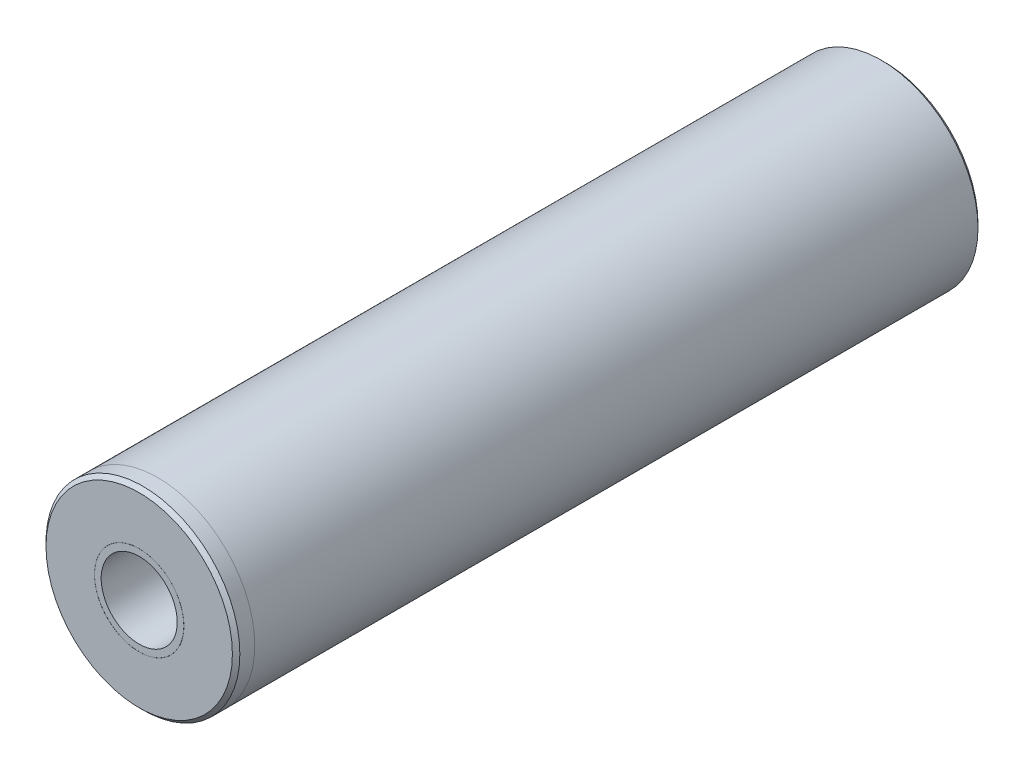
ISO-10303-21;
HEADER;
FILE_DESCRIPTION(('STEP AP214'),'2;1');
FILE_NAME('part.step','',(''),(''),'','','');
FILE_SCHEMA(('AUTOMOTIVE_DESIGN { 1 0 10303 214 1 1 1 1 }'));
ENDSEC;
DATA;
#1=APPLICATION_CONTEXT('core data for automotive mechanical design processes');
#2=APPLICATION_PROTOCOL_DEFINITION('international standard','automotive_design',2000,#1);
#3=PRODUCT_CONTEXT('',#1,'mechanical');
#4=PRODUCT('Part','Part','',(#3));
#5=PRODUCT_RELATED_PRODUCT_CATEGORY('part','',(#4));
#6=PRODUCT_DEFINITION_FORMATION('','',#4);
#7=PRODUCT_DEFINITION_CONTEXT('part definition',#1,'design');
#8=PRODUCT_DEFINITION('design','',#6,#7);
#9=PRODUCT_DEFINITION_SHAPE('','',#8);
#10=(LENGTH_UNIT() NAMED_UNIT(*) SI_UNIT(.MILLI.,.METRE.));
#11=(NAMED_UNIT(*) PLANE_ANGLE_UNIT() SI_UNIT($,.RADIAN.));
#12=(NAMED_UNIT(*) SI_UNIT($,.STERADIAN.) SOLID_ANGLE_UNIT());
#13=UNCERTAINTY_MEASURE_WITH_UNIT(LENGTH_MEASURE(1.E-05),#10,'distance_accuracy_value','');
#14=(GEOMETRIC_REPRESENTATION_CONTEXT(3) GLOBAL_UNCERTAINTY_ASSIGNED_CONTEXT((#13)) GLOBAL_UNIT_ASSIGNED_CONTEXT((#10,
#11,#12)) REPRESENTATION_CONTEXT('',''));
#15=CARTESIAN_POINT('',(0.,0.,0.));
#16=DIRECTION('',(0.,0.,1.));
#17=DIRECTION('',(1.,0.,0.));
#18=AXIS2_PLACEMENT_3D('',#15,#16,#17);
#19=CARTESIAN_POINT('',(0.,5.99,0.));
#20=DIRECTION('',(0.,0.,-1.));
#21=DIRECTION('',(-1.,0.,0.));
#22=AXIS2_PLACEMENT_3D('',#19,#20,#21);
#23=PLANE('',#22);
#24=CARTESIAN_POINT('',(0.,0.,0.));
#25=DIRECTION('',(0.,0.,1.));
#26=DIRECTION('',(1.,0.,0.));
#27=AXIS2_PLACEMENT_3D('',#24,#25,#26);
#28=CIRCLE('',#27,5.1);
#29=CARTESIAN_POINT('',(5.1,0.,0.));
#30=VERTEX_POINT('',#29);
#31=EDGE_CURVE('E10',#30,#30,#28,.T.);
#32=ORIENTED_EDGE('',*,*,#31,.F.);
#33=EDGE_LOOP('',(#32));
#34=FACE_BOUND('',#33,.T.);
#35=CARTESIAN_POINT('',(0.,0.,0.));
#36=DIRECTION('',(0.,0.,1.));
#37=DIRECTION('',(1.,0.,0.));
#38=AXIS2_PLACEMENT_3D('',#35,#36,#37);
#39=CIRCLE('',#38,5.99);
#40=CARTESIAN_POINT('',(5.99,0.,0.));
#41=VERTEX_POINT('',#40);
#42=EDGE_CURVE('E83',#41,#41,#39,.T.);
#43=ORIENTED_EDGE('',*,*,#42,.T.);
#44=EDGE_LOOP('',(#43));
#45=FACE_BOUND('',#44,.T.);
#46=ADVANCED_FACE('F34',(#34,#45),#23,.F.);
#47=CARTESIAN_POINT('',(0.,0.,0.));
#48=DIRECTION('',(0.,0.,1.));
#49=DIRECTION('',(1.,0.,0.));
#50=AXIS2_PLACEMENT_3D('',#47,#48,#49);
#51=CYLINDRICAL_SURFACE('',#50,5.1);
#52=CARTESIAN_POINT('',(0.,0.,-9.88230854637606));
#53=DIRECTION('',(0.,0.,1.));
#54=DIRECTION('',(1.,0.,0.));
#55=AXIS2_PLACEMENT_3D('',#52,#53,#54);
#56=CIRCLE('',#55,5.1);
#57=CARTESIAN_POINT('',(5.1,0.,-9.88230854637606));
#58=VERTEX_POINT('',#57);
#59=EDGE_CURVE('E40',#58,#58,#56,.T.);
#60=ORIENTED_EDGE('',*,*,#59,.F.);
#61=EDGE_LOOP('',(#60));
#62=FACE_BOUND('',#61,.T.);
#63=ORIENTED_EDGE('',*,*,#31,.T.);
#64=EDGE_LOOP('',(#63));
#65=FACE_BOUND('',#64,.T.);
#66=ADVANCED_FACE('F162',(#62,#65),#51,.F.);
#67=CARTESIAN_POINT('',(0.,0.,-9.88230854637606));
#68=DIRECTION('',(0.,0.,-1.));
#69=DIRECTION('',(-1.,0.,0.));
#70=AXIS2_PLACEMENT_3D('',#67,#68,#69);
#71=CONICAL_SURFACE('',#70,5.1,1.0471975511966);
#72=CARTESIAN_POINT('',(0.,0.,-13.));
#73=DIRECTION('',(0.,0.,1.));
#74=DIRECTION('',(1.,0.,0.));
#75=AXIS2_PLACEMENT_3D('',#72,#73,#74);
#76=CIRCLE('',#75,10.5);
#77=CARTESIAN_POINT('',(10.5,0.,-13.));
#78=VERTEX_POINT('',#77);
#79=EDGE_CURVE('E44',#78,#78,#76,.T.);
#80=ORIENTED_EDGE('',*,*,#79,.F.);
#81=EDGE_LOOP('',(#80));
#82=FACE_BOUND('',#81,.T.);
#83=ORIENTED_EDGE('',*,*,#59,.T.);
#84=EDGE_LOOP('',(#83));
#85=FACE_BOUND('',#84,.T.);
#86=ADVANCED_FACE('F157',(#82,#85),#71,.F.);
#87=CARTESIAN_POINT('',(0.,0.,0.));
#88=DIRECTION('',(0.,0.,1.));
#89=DIRECTION('',(1.,0.,0.));
#90=AXIS2_PLACEMENT_3D('',#87,#88,#89);
#91=CYLINDRICAL_SURFACE('',#90,10.5);
#92=CARTESIAN_POINT('',(0.,0.,-99.5));
#93=DIRECTION('',(0.,0.,1.));
#94=DIRECTION('',(1.,0.,0.));
#95=AXIS2_PLACEMENT_3D('',#92,#93,#94);
#96=CIRCLE('',#95,10.5);
#97=CARTESIAN_POINT('',(10.5,0.,-99.5));
#98=VERTEX_POINT('',#97);
#99=EDGE_CURVE('E48',#98,#98,#96,.T.);
#100=ORIENTED_EDGE('',*,*,#99,.F.);
#101=EDGE_LOOP('',(#100));
#102=FACE_BOUND('',#101,.T.);
#103=ORIENTED_EDGE('',*,*,#79,.T.);
#104=EDGE_LOOP('',(#103));
#105=FACE_BOUND('',#104,.T.);
#106=ADVANCED_FACE('F151',(#102,#105),#91,.F.);
#107=CARTESIAN_POINT('',(0.,0.,-99.5));
#108=DIRECTION('',(0.,0.,-1.));
#109=DIRECTION('',(-1.,0.,0.));
#110=AXIS2_PLACEMENT_3D('',#107,#108,#109);
#111=CONICAL_SURFACE('',#110,10.5,0.785398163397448);
#112=CARTESIAN_POINT('',(0.,0.,-100.));
#113=DIRECTION('',(0.,0.,1.));
#114=DIRECTION('',(1.,0.,0.));
#115=AXIS2_PLACEMENT_3D('',#112,#113,#114);
#116=CIRCLE('',#115,11.);
#117=CARTESIAN_POINT('',(11.,0.,-100.));
#118=VERTEX_POINT('',#117);
#119=EDGE_CURVE('E53',#118,#118,#116,.T.);
#120=ORIENTED_EDGE('',*,*,#119,.F.);
#121=EDGE_LOOP('',(#120));
#122=FACE_BOUND('',#121,.T.);
#123=ORIENTED_EDGE('',*,*,#99,.T.);
#124=EDGE_LOOP('',(#123));
#125=FACE_BOUND('',#124,.T.);
#126=ADVANCED_FACE('F145',(#122,#125),#111,.F.);
#127=CARTESIAN_POINT('',(0.,12.499,-100.));
#128=DIRECTION('',(0.,0.,1.));
#129=DIRECTION('',(1.,0.,0.));
#130=AXIS2_PLACEMENT_3D('',#127,#128,#129);
#131=PLANE('',#130);
#132=CARTESIAN_POINT('',(0.,0.,-100.));
#133=DIRECTION('',(0.,0.,1.));
#134=DIRECTION('',(1.,0.,0.));
#135=AXIS2_PLACEMENT_3D('',#132,#133,#134);
#136=CIRCLE('',#135,12.499);
#137=CARTESIAN_POINT('',(12.499,0.,-100.));
#138=VERTEX_POINT('',#137);
#139=EDGE_CURVE('E56',#138,#138,#136,.T.);
#140=ORIENTED_EDGE('',*,*,#139,.F.);
#141=EDGE_LOOP('',(#140));
#142=FACE_BOUND('',#141,.T.);
#143=ORIENTED_EDGE('',*,*,#119,.T.);
#144=EDGE_LOOP('',(#143));
#145=FACE_BOUND('',#144,.T.);
#146=ADVANCED_FACE('F139',(#142,#145),#131,.F.);
#147=CARTESIAN_POINT('',(0.,0.,-100.));
#148=DIRECTION('',(0.,0.,1.));
#149=DIRECTION('',(1.,0.,0.));
#150=AXIS2_PLACEMENT_3D('',#147,#148,#149);
#151=CONICAL_SURFACE('',#150,12.499,0.785398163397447);
#152=CARTESIAN_POINT('',(0.,0.,-99.5));
#153=DIRECTION('',(0.,0.,1.));
#154=DIRECTION('',(1.,0.,0.));
#155=AXIS2_PLACEMENT_3D('',#152,#153,#154);
#156=CIRCLE('',#155,12.999);
#157=CARTESIAN_POINT('',(12.999,0.,-99.5));
#158=VERTEX_POINT('',#157);
#159=EDGE_CURVE('E59',#158,#158,#156,.T.);
#160=ORIENTED_EDGE('',*,*,#159,.F.);
#161=EDGE_LOOP('',(#160));
#162=FACE_BOUND('',#161,.T.);
#163=ORIENTED_EDGE('',*,*,#139,.T.);
#164=EDGE_LOOP('',(#163));
#165=FACE_BOUND('',#164,.T.);
#166=ADVANCED_FACE('F133',(#162,#165),#151,.T.);
#167=CARTESIAN_POINT('',(0.,0.,0.));
#168=DIRECTION('',(0.,0.,1.));
#169=DIRECTION('',(1.,0.,0.));
#170=AXIS2_PLACEMENT_3D('',#167,#168,#169);
#171=CYLINDRICAL_SURFACE('',#170,12.999);
#172=CARTESIAN_POINT('',(0.,0.,-2.5));
#173=DIRECTION('',(0.,0.,1.));
#174=DIRECTION('',(1.,0.,0.));
#175=AXIS2_PLACEMENT_3D('',#172,#173,#174);
#176=CIRCLE('',#175,12.999);
#177=CARTESIAN_POINT('',(12.999,0.,-2.5));
#178=VERTEX_POINT('',#177);
#179=EDGE_CURVE('E62',#178,#178,#176,.T.);
#180=ORIENTED_EDGE('',*,*,#179,.F.);
#181=EDGE_LOOP('',(#180));
#182=FACE_BOUND('',#181,.T.);
#183=ORIENTED_EDGE('',*,*,#159,.T.);
#184=EDGE_LOOP('',(#183));
#185=FACE_BOUND('',#184,.T.);
#186=ADVANCED_FACE('F127',(#182,#185),#171,.T.);
#187=CARTESIAN_POINT('',(0.,13.,-2.5));
#188=DIRECTION('',(0.,0.,1.));
#189=DIRECTION('',(1.,0.,0.));
#190=AXIS2_PLACEMENT_3D('',#187,#188,#189);
#191=PLANE('',#190);
#192=CARTESIAN_POINT('',(0.,0.,-2.5));
#193=DIRECTION('',(0.,0.,1.));
#194=DIRECTION('',(1.,0.,0.));
#195=AXIS2_PLACEMENT_3D('',#192,#193,#194);
#196=CIRCLE('',#195,13.);
#197=CARTESIAN_POINT('',(13.,0.,-2.5));
#198=VERTEX_POINT('',#197);
#199=EDGE_CURVE('E65',#198,#198,#196,.T.);
#200=ORIENTED_EDGE('',*,*,#199,.F.);
#201=EDGE_LOOP('',(#200));
#202=FACE_BOUND('',#201,.T.);
#203=ORIENTED_EDGE('',*,*,#179,.T.);
#204=EDGE_LOOP('',(#203));
#205=FACE_BOUND('',#204,.T.);
#206=ADVANCED_FACE('F121',(#202,#205),#191,.F.);
#207=CARTESIAN_POINT('',(0.,0.,0.));
#208=DIRECTION('',(0.,0.,1.));
#209=DIRECTION('',(1.,0.,0.));
#210=AXIS2_PLACEMENT_3D('',#207,#208,#209);
#211=CYLINDRICAL_SURFACE('',#210,13.);
#212=CARTESIAN_POINT('',(0.,0.,-0.499999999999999));
#213=DIRECTION('',(0.,0.,1.));
#214=DIRECTION('',(1.,0.,0.));
#215=AXIS2_PLACEMENT_3D('',#212,#213,#214);
#216=CIRCLE('',#215,13.);
#217=CARTESIAN_POINT('',(13.,0.,-0.499999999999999));
#218=VERTEX_POINT('',#217);
#219=EDGE_CURVE('E68',#218,#218,#216,.T.);
#220=ORIENTED_EDGE('',*,*,#219,.F.);
#221=EDGE_LOOP('',(#220));
#222=FACE_BOUND('',#221,.T.);
#223=ORIENTED_EDGE('',*,*,#199,.T.);
#224=EDGE_LOOP('',(#223));
#225=FACE_BOUND('',#224,.T.);
#226=ADVANCED_FACE('F115',(#222,#225),#211,.T.);
#227=CARTESIAN_POINT('',(0.,0.,-0.499999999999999));
#228=DIRECTION('',(0.,0.,-1.));
#229=DIRECTION('',(-1.,0.,0.));
#230=AXIS2_PLACEMENT_3D('',#227,#228,#229);
#231=CONICAL_SURFACE('',#230,13.,0.78539816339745);
#232=CARTESIAN_POINT('',(0.,0.,0.));
#233=DIRECTION('',(0.,0.,1.));
#234=DIRECTION('',(1.,0.,0.));
#235=AXIS2_PLACEMENT_3D('',#232,#233,#234);
#236=CIRCLE('',#235,12.5);
#237=CARTESIAN_POINT('',(12.5,0.,0.));
#238=VERTEX_POINT('',#237);
#239=EDGE_CURVE('E71',#238,#238,#236,.T.);
#240=ORIENTED_EDGE('',*,*,#239,.F.);
#241=EDGE_LOOP('',(#240));
#242=FACE_BOUND('',#241,.T.);
#243=ORIENTED_EDGE('',*,*,#219,.T.);
#244=EDGE_LOOP('',(#243));
#245=FACE_BOUND('',#244,.T.);
#246=ADVANCED_FACE('F109',(#242,#245),#231,.T.);
#247=CARTESIAN_POINT('',(0.,12.5,0.));
#248=DIRECTION('',(0.,0.,-1.));
#249=DIRECTION('',(-1.,0.,0.));
#250=AXIS2_PLACEMENT_3D('',#247,#248,#249);
#251=PLANE('',#250);
#252=CARTESIAN_POINT('',(0.,0.,0.));
#253=DIRECTION('',(0.,0.,1.));
#254=DIRECTION('',(1.,0.,0.));
#255=AXIS2_PLACEMENT_3D('',#252,#253,#254);
#256=CIRCLE('',#255,6.);
#257=CARTESIAN_POINT('',(6.,0.,0.));
#258=VERTEX_POINT('',#257);
#259=EDGE_CURVE('E74',#258,#258,#256,.T.);
#260=ORIENTED_EDGE('',*,*,#259,.F.);
#261=EDGE_LOOP('',(#260));
#262=FACE_BOUND('',#261,.T.);
#263=ORIENTED_EDGE('',*,*,#239,.T.);
#264=EDGE_LOOP('',(#263));
#265=FACE_BOUND('',#264,.T.);
#266=ADVANCED_FACE('F103',(#262,#265),#251,.F.);
#267=CARTESIAN_POINT('',(0.,0.,0.));
#268=DIRECTION('',(0.,0.,1.));
#269=DIRECTION('',(1.,0.,0.));
#270=AXIS2_PLACEMENT_3D('',#267,#268,#269);
#271=CYLINDRICAL_SURFACE('',#270,6.);
#272=CARTESIAN_POINT('',(0.,0.,-10.3903767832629));
#273=DIRECTION('',(0.,0.,1.));
#274=DIRECTION('',(1.,0.,0.));
#275=AXIS2_PLACEMENT_3D('',#272,#273,#274);
#276=CIRCLE('',#275,6.);
#277=CARTESIAN_POINT('',(6.,0.,-10.3903767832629));
#278=VERTEX_POINT('',#277);
#279=EDGE_CURVE('E77',#278,#278,#276,.T.);
#280=ORIENTED_EDGE('',*,*,#279,.F.);
#281=EDGE_LOOP('',(#280));
#282=FACE_BOUND('',#281,.T.);
#283=ORIENTED_EDGE('',*,*,#259,.T.);
#284=EDGE_LOOP('',(#283));
#285=FACE_BOUND('',#284,.T.);
#286=ADVANCED_FACE('F97',(#282,#285),#271,.F.);
#287=CARTESIAN_POINT('',(0.,0.,-10.3903767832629));
#288=DIRECTION('',(0.,0.,-1.));
#289=DIRECTION('',(-1.,0.,0.));
#290=AXIS2_PLACEMENT_3D('',#287,#288,#289);
#291=CONICAL_SURFACE('',#290,6.,1.04719755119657);
#292=CARTESIAN_POINT('',(0.,0.,-10.384603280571));
#293=DIRECTION('',(0.,0.,1.));
#294=DIRECTION('',(1.,0.,0.));
#295=AXIS2_PLACEMENT_3D('',#292,#293,#294);
#296=CIRCLE('',#295,5.99);
#297=CARTESIAN_POINT('',(5.99,0.,-10.384603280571));
#298=VERTEX_POINT('',#297);
#299=EDGE_CURVE('E80',#298,#298,#296,.T.);
#300=ORIENTED_EDGE('',*,*,#299,.F.);
#301=EDGE_LOOP('',(#300));
#302=FACE_BOUND('',#301,.T.);
#303=ORIENTED_EDGE('',*,*,#279,.T.);
#304=EDGE_LOOP('',(#303));
#305=FACE_BOUND('',#304,.T.);
#306=ADVANCED_FACE('F91',(#302,#305),#291,.T.);
#307=CARTESIAN_POINT('',(0.,0.,0.));
#308=DIRECTION('',(0.,0.,1.));
#309=DIRECTION('',(1.,0.,0.));
#310=AXIS2_PLACEMENT_3D('',#307,#308,#309);
#311=CYLINDRICAL_SURFACE('',#310,5.99);
#312=ORIENTED_EDGE('',*,*,#42,.F.);
#313=EDGE_LOOP('',(#312));
#314=FACE_BOUND('',#313,.T.);
#315=ORIENTED_EDGE('',*,*,#299,.T.);
#316=EDGE_LOOP('',(#315));
#317=FACE_BOUND('',#316,.T.);
#318=ADVANCED_FACE('F88',(#314,#317),#311,.T.);
#319=CLOSED_SHELL('',(#46,#66,#86,#106,#126,#146,#166,#186,#206,#226,#246,#266,#286,#306,#318));
#320=MANIFOLD_SOLID_BREP('B2',#319);
#321=ADVANCED_BREP_SHAPE_REPRESENTATION('',(#18,#320),#14);
#322=SHAPE_DEFINITION_REPRESENTATION(#9,#321);
ENDSEC;
END-ISO-10303-21;
